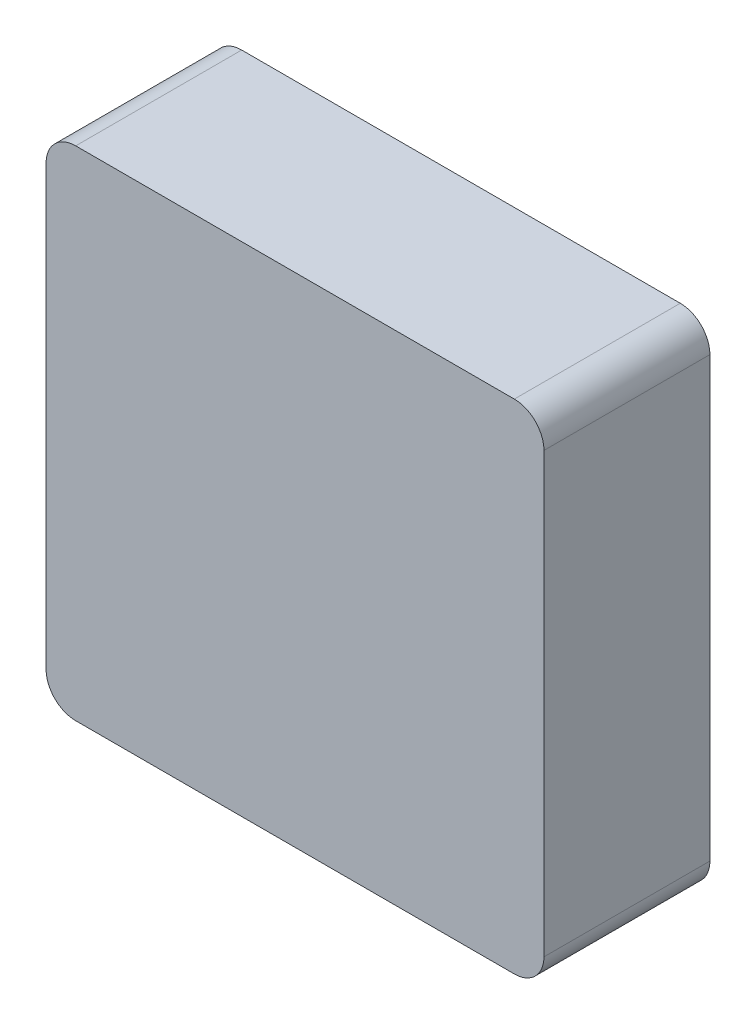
from build123d import *

# Parameters (mm, degrees)
BOSS_EXTRUDE1_DEPTH = 28


with BuildPart() as part:
    # Sketch1 → Boss-Extrude1 (new body)
    with BuildSketch(Plane(origin=(0, 0, 0), x_dir=(0, 1, 0), z_dir=(0, 0, 1))):
        with BuildLine():
            Line((-37, -42), (37, -42))
            ThreePointArc((37, -42), (40.535533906, -40.535533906), (42, -37))
            Line((42, -37), (42, 37))
            ThreePointArc((42, 37), (40.535533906, 40.535533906), (37, 42))
            Line((37, 42), (-37, 42))
            ThreePointArc((-37, 42), (-40.535533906, 40.535533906), (-42, 37))
            Line((-42, 37), (-42, -37))
            ThreePointArc((-42, -37), (-40.535533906, -40.535533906), (-37, -42))
        make_face()
    extrude(amount=BOSS_EXTRUDE1_DEPTH)


solid = part.part
